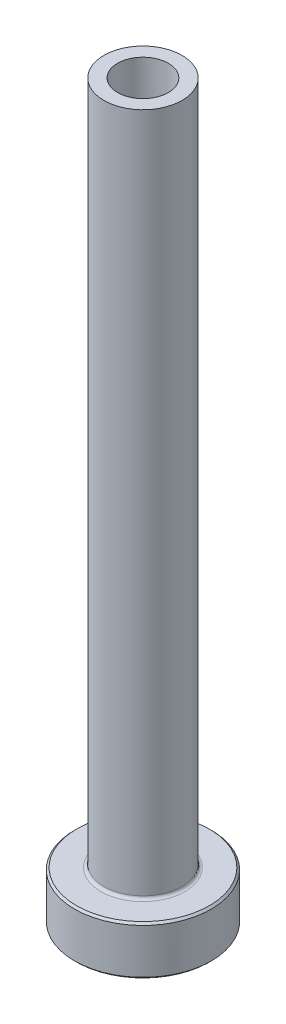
from build123d import *

# Parameters (mm, degrees)
FILLET1_R     = 0.3
CHAMFER1_SIZE = 0.2
CHAMFER3_SIZE = 0.5


with BuildPart() as part:
    # Sketch1 → Revolve1 (revolve)
    with BuildSketch(Plane.XY, mode=Mode.PRIVATE) as revolve1_sk:
        Polygon((-2.6, 75), (-4, 75), (-4, 5), (-7, 5), (-7, 0), (-2.85, 0), (-2.85, 18), (-2.6, 30), align=None)
    revolve(revolve1_sk.sketch.rotate(Axis((0, 92.187680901, 0), (0, -1, 0)), 270), axis=Axis((0, 92.187680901, 0), (0, -1, 0)))

    # Fillet1
    fillet1_edges = [part.edges().sort_by_distance(p)[0] for p in [
        (0, 5, -4),
    ]]
    fillet(fillet1_edges, radius=FILLET1_R)

    # Chamfer1
    chamfer1_edges = [part.edges().sort_by_distance(p)[0] for p in [
        (0, 0, -7),
        (0, 5, -7),
    ]]
    chamfer(chamfer1_edges, length=CHAMFER1_SIZE)

    # Chamfer3
    chamfer3_edges = [part.edges().sort_by_distance(p)[0] for p in [
        (0, 0, -2.85),
    ]]
    chamfer(chamfer3_edges, length=CHAMFER3_SIZE)


solid = part.part
